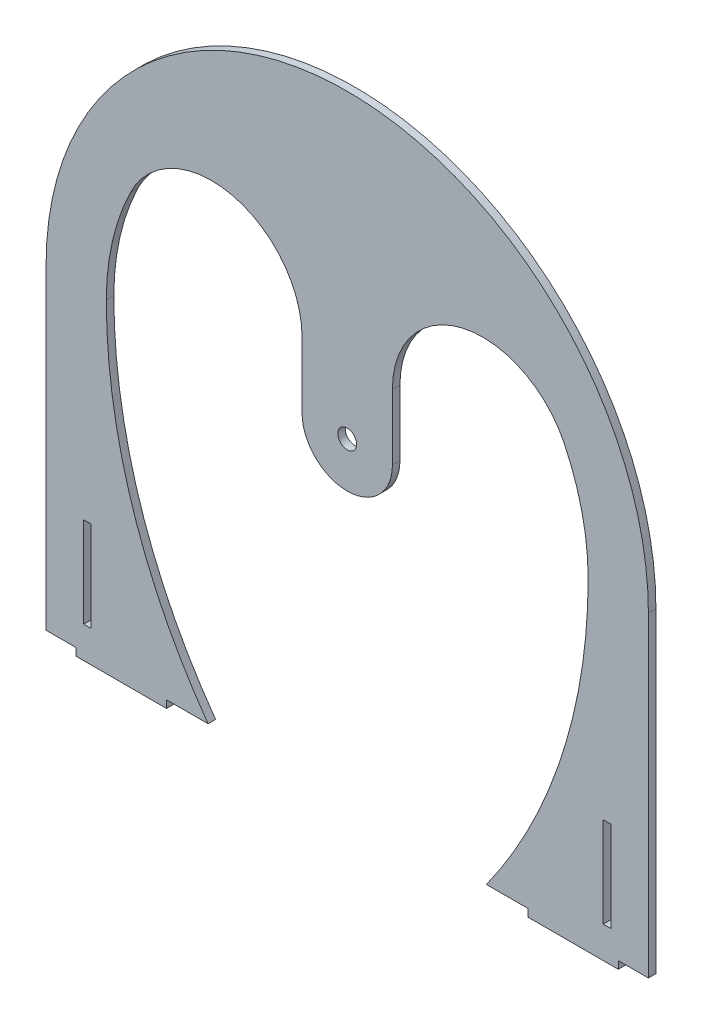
from build123d import *

# Parameters (mm, degrees)
SKETCH1_W           = 3.175
SKETCH1_H           = 38.1
SKETCH1_R           = 3.96875
BOSS_EXTRUDE1_DEPTH = 3.175
FILLET1_R           = 38.1
SKETCH3_W           = 38.1
SKETCH3_H           = 3.175
BOSS_EXTRUDE2_DEPTH = 3.175


with BuildPart() as part:
    # Sketch1 → Boss-Extrude1 (new body)
    with BuildSketch(Plane.XY):
        with BuildLine():
            Line((-127, -133.35), (-58.676432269, -133.35))
            ThreePointArc((-58.676432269, -133.35), (-90.604678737, -70.044013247), (-101.6, 0))
            ThreePointArc((-101.6, 0), (-78.288057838, 64.757547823), (-19.05, 99.798083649))
            Line((-19.05, 99.798083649), (-19.05, -1e-07))
            ThreePointArc((-19.05, -1e-07), (-13.470384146, -13.470384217), (0, -19.05))
            ThreePointArc((0, -19.05), (13.470384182, -13.470384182), (19.05, 0))
            Line((19.05, 0), (19.05, 99.798083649))
            ThreePointArc((19.05, 99.798083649), (78.288057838, 64.757547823), (101.6, 0))
            ThreePointArc((101.6, 0), (90.604678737, -70.044013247), (58.676432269, -133.35))
            Line((58.676432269, -133.35), (127, -133.35))
            Line((127, -133.35), (127, 0))
            ThreePointArc((127, 0), (-4.1e-08, 127), (-127, -8.1e-08))
            Line((-127, -8.1e-08), (-127, -133.35))
        make_face()
        with Locations((-109.5375, -104.14)):
            Rectangle(SKETCH1_W, SKETCH1_H, mode=Mode.SUBTRACT)
        Circle(SKETCH1_R, mode=Mode.SUBTRACT)
        with Locations((109.5375, -104.14)):
            Rectangle(SKETCH1_W, SKETCH1_H, mode=Mode.SUBTRACT)
    extrude(amount=BOSS_EXTRUDE1_DEPTH)

    # Fillet1
    fillet1_edges = [part.edges().sort_by_distance(p)[0] for p in [
        (19.05, 99.798083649, 1.5875),
        (-19.05, 99.798083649, 1.5875),
    ]]
    fillet(fillet1_edges, radius=FILLET1_R)

    # Sketch3 → Boss-Extrude2 (add)
    with BuildSketch(Plane.XZ.offset(133.35)):
        with Locations((-95.25, 1.5875)):
            Rectangle(SKETCH3_W, SKETCH3_H)
        with Locations((95.25, 1.5875)):
            Rectangle(SKETCH3_W, SKETCH3_H)
    extrude(amount=BOSS_EXTRUDE2_DEPTH)


solid = part.part
